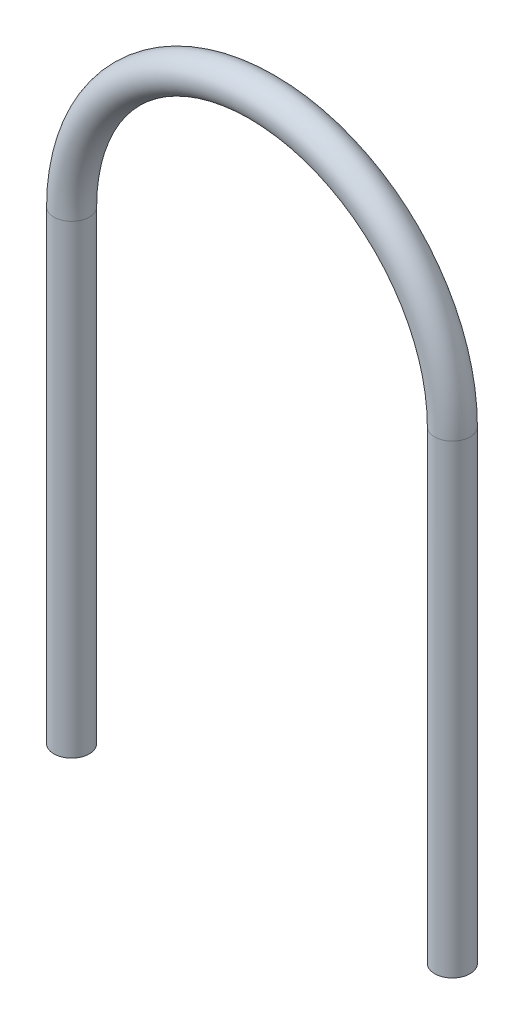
ISO-10303-21;
HEADER;
FILE_DESCRIPTION(('STEP AP214'),'2;1');
FILE_NAME('part.step','',(''),(''),'','','');
FILE_SCHEMA(('AUTOMOTIVE_DESIGN { 1 0 10303 214 1 1 1 1 }'));
ENDSEC;
DATA;
#1=APPLICATION_CONTEXT('core data for automotive mechanical design processes');
#2=APPLICATION_PROTOCOL_DEFINITION('international standard','automotive_design',2000,#1);
#3=PRODUCT_CONTEXT('',#1,'mechanical');
#4=PRODUCT('Part','Part','',(#3));
#5=PRODUCT_RELATED_PRODUCT_CATEGORY('part','',(#4));
#6=PRODUCT_DEFINITION_FORMATION('','',#4);
#7=PRODUCT_DEFINITION_CONTEXT('part definition',#1,'design');
#8=PRODUCT_DEFINITION('design','',#6,#7);
#9=PRODUCT_DEFINITION_SHAPE('','',#8);
#10=(LENGTH_UNIT() NAMED_UNIT(*) SI_UNIT(.MILLI.,.METRE.));
#11=(NAMED_UNIT(*) PLANE_ANGLE_UNIT() SI_UNIT($,.RADIAN.));
#12=(NAMED_UNIT(*) SI_UNIT($,.STERADIAN.) SOLID_ANGLE_UNIT());
#13=UNCERTAINTY_MEASURE_WITH_UNIT(LENGTH_MEASURE(1.E-05),#10,'distance_accuracy_value','');
#14=(GEOMETRIC_REPRESENTATION_CONTEXT(3) GLOBAL_UNCERTAINTY_ASSIGNED_CONTEXT((#13)) GLOBAL_UNIT_ASSIGNED_CONTEXT((#10,
#11,#12)) REPRESENTATION_CONTEXT('',''));
#15=CARTESIAN_POINT('',(0.,0.,0.));
#16=DIRECTION('',(0.,0.,1.));
#17=DIRECTION('',(1.,0.,0.));
#18=AXIS2_PLACEMENT_3D('',#15,#16,#17);
#19=CARTESIAN_POINT('',(-34.13125,0.,0.));
#20=DIRECTION('',(0.,-1.,0.));
#21=DIRECTION('',(1.,0.,0.));
#22=AXIS2_PLACEMENT_3D('',#19,#20,#21);
#23=CYLINDRICAL_SURFACE('',#22,3.175);
#24=CARTESIAN_POINT('',(-34.13125,0.,0.));
#25=DIRECTION('',(0.,-1.,0.));
#26=DIRECTION('',(0.,0.,1.));
#27=AXIS2_PLACEMENT_3D('',#24,#25,#26);
#28=CIRCLE('',#27,3.175);
#29=CARTESIAN_POINT('',(-37.30625,0.,0.));
#30=VERTEX_POINT('',#29);
#31=EDGE_CURVE('E36',#30,#30,#28,.T.);
#32=ORIENTED_EDGE('',*,*,#31,.T.);
#33=EDGE_LOOP('',(#32));
#34=FACE_BOUND('',#33,.T.);
#35=CARTESIAN_POINT('',(-34.13125,-83.34375,0.));
#36=DIRECTION('',(0.,-1.,0.));
#37=DIRECTION('',(0.,0.,1.));
#38=AXIS2_PLACEMENT_3D('',#35,#36,#37);
#39=CIRCLE('',#38,3.175);
#40=CARTESIAN_POINT('',(-34.13125,-83.34375,3.175));
#41=VERTEX_POINT('',#40);
#42=EDGE_CURVE('E10',#41,#41,#39,.T.);
#43=ORIENTED_EDGE('',*,*,#42,.F.);
#44=EDGE_LOOP('',(#43));
#45=FACE_BOUND('',#44,.T.);
#46=ADVANCED_FACE('F30',(#34,#45),#23,.T.);
#47=CARTESIAN_POINT('',(0.,0.,0.));
#48=DIRECTION('',(0.,0.,1.));
#49=DIRECTION('',(1.,0.,0.));
#50=AXIS2_PLACEMENT_3D('',#47,#48,#49);
#51=TOROIDAL_SURFACE('',#50,34.13125,3.175);
#52=CARTESIAN_POINT('',(34.13125,0.,0.));
#53=DIRECTION('',(0.,1.,0.));
#54=DIRECTION('',(0.,0.,1.));
#55=AXIS2_PLACEMENT_3D('',#52,#53,#54);
#56=CIRCLE('',#55,3.175);
#57=CARTESIAN_POINT('',(37.30625,0.,0.));
#58=VERTEX_POINT('',#57);
#59=EDGE_CURVE('E40',#58,#58,#56,.T.);
#60=CARTESIAN_POINT('',(0.,0.,0.));
#61=DIRECTION('',(0.,0.,1.));
#62=DIRECTION('',(1.,0.,0.));
#63=AXIS2_PLACEMENT_3D('',#60,#61,#62);
#64=CIRCLE('',#63,37.30625);
#65=EDGE_CURVE('',#58,#30,#64,.T.);
#66=ORIENTED_EDGE('',*,*,#59,.T.);
#67=ORIENTED_EDGE('',*,*,#31,.F.);
#68=ORIENTED_EDGE('',*,*,#65,.T.);
#69=ORIENTED_EDGE('',*,*,#65,.F.);
#70=EDGE_LOOP('',(#66,#68,#67,#69));
#71=FACE_BOUND('',#70,.T.);
#72=ADVANCED_FACE('F62',(#71),#51,.T.);
#73=CARTESIAN_POINT('',(34.13125,0.,0.));
#74=DIRECTION('',(0.,-1.,0.));
#75=DIRECTION('',(1.,0.,0.));
#76=AXIS2_PLACEMENT_3D('',#73,#74,#75);
#77=CYLINDRICAL_SURFACE('',#76,3.175);
#78=ORIENTED_EDGE('',*,*,#59,.F.);
#79=EDGE_LOOP('',(#78));
#80=FACE_BOUND('',#79,.T.);
#81=CARTESIAN_POINT('',(34.13125,-83.34375,0.));
#82=DIRECTION('',(0.,1.,0.));
#83=DIRECTION('',(0.,0.,1.));
#84=AXIS2_PLACEMENT_3D('',#81,#82,#83);
#85=CIRCLE('',#84,3.175);
#86=CARTESIAN_POINT('',(34.13125,-83.34375,3.175));
#87=VERTEX_POINT('',#86);
#88=EDGE_CURVE('E44',#87,#87,#85,.T.);
#89=ORIENTED_EDGE('',*,*,#88,.T.);
#90=EDGE_LOOP('',(#89));
#91=FACE_BOUND('',#90,.T.);
#92=ADVANCED_FACE('F50',(#80,#91),#77,.T.);
#93=CARTESIAN_POINT('',(-34.13125,-83.34375,0.));
#94=DIRECTION('',(0.,-1.,0.));
#95=DIRECTION('',(0.,0.,1.));
#96=AXIS2_PLACEMENT_3D('',#93,#94,#95);
#97=PLANE('',#96);
#98=ORIENTED_EDGE('',*,*,#42,.T.);
#99=EDGE_LOOP('',(#98));
#100=FACE_BOUND('',#99,.T.);
#101=ADVANCED_FACE('F54',(#100),#97,.T.);
#102=CARTESIAN_POINT('',(34.13125,-83.34375,0.));
#103=DIRECTION('',(0.,1.,0.));
#104=DIRECTION('',(0.,0.,1.));
#105=AXIS2_PLACEMENT_3D('',#102,#103,#104);
#106=PLANE('',#105);
#107=ORIENTED_EDGE('',*,*,#88,.F.);
#108=EDGE_LOOP('',(#107));
#109=FACE_BOUND('',#108,.T.);
#110=ADVANCED_FACE('F52',(#109),#106,.F.);
#111=CLOSED_SHELL('',(#46,#72,#92,#101,#110));
#112=MANIFOLD_SOLID_BREP('B2',#111);
#113=ADVANCED_BREP_SHAPE_REPRESENTATION('',(#18,#112),#14);
#114=SHAPE_DEFINITION_REPRESENTATION(#9,#113);
ENDSEC;
END-ISO-10303-21;
